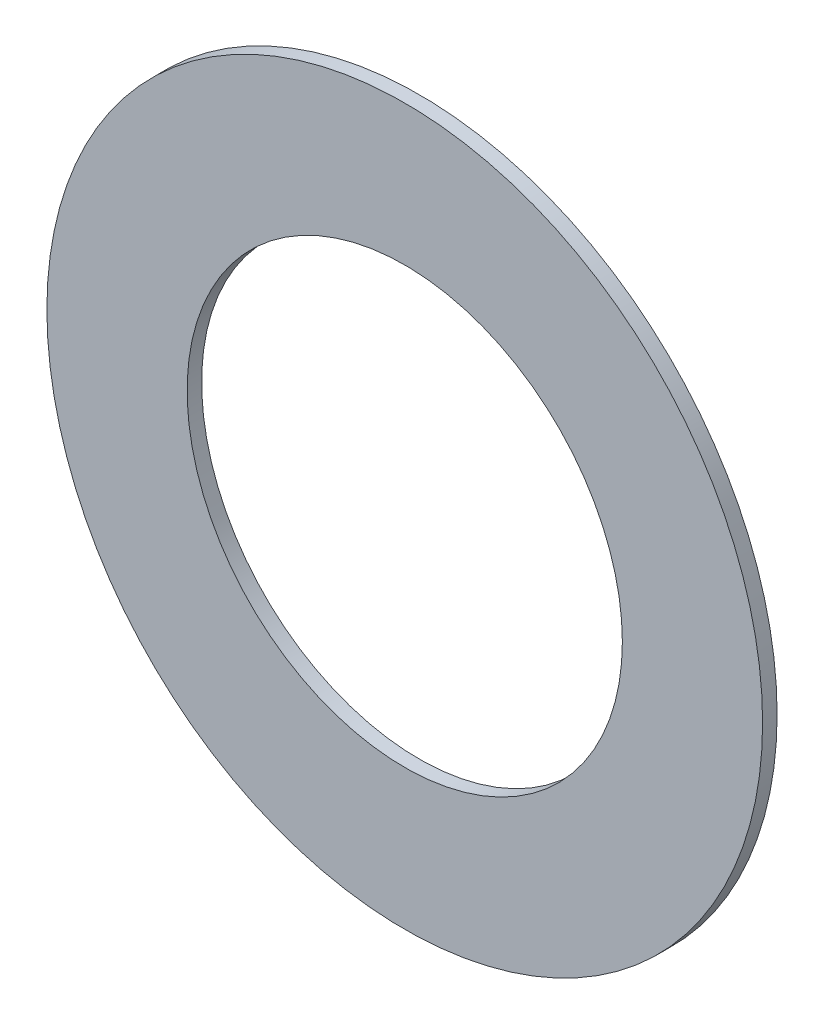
ISO-10303-21;
HEADER;
FILE_DESCRIPTION(('STEP AP214'),'2;1');
FILE_NAME('part.step','',(''),(''),'','','');
FILE_SCHEMA(('AUTOMOTIVE_DESIGN { 1 0 10303 214 1 1 1 1 }'));
ENDSEC;
DATA;
#1=APPLICATION_CONTEXT('core data for automotive mechanical design processes');
#2=APPLICATION_PROTOCOL_DEFINITION('international standard','automotive_design',2000,#1);
#3=PRODUCT_CONTEXT('',#1,'mechanical');
#4=PRODUCT('Part','Part','',(#3));
#5=PRODUCT_RELATED_PRODUCT_CATEGORY('part','',(#4));
#6=PRODUCT_DEFINITION_FORMATION('','',#4);
#7=PRODUCT_DEFINITION_CONTEXT('part definition',#1,'design');
#8=PRODUCT_DEFINITION('design','',#6,#7);
#9=PRODUCT_DEFINITION_SHAPE('','',#8);
#10=(LENGTH_UNIT() NAMED_UNIT(*) SI_UNIT(.MILLI.,.METRE.));
#11=(NAMED_UNIT(*) PLANE_ANGLE_UNIT() SI_UNIT($,.RADIAN.));
#12=(NAMED_UNIT(*) SI_UNIT($,.STERADIAN.) SOLID_ANGLE_UNIT());
#13=UNCERTAINTY_MEASURE_WITH_UNIT(LENGTH_MEASURE(1.E-05),#10,'distance_accuracy_value','');
#14=(GEOMETRIC_REPRESENTATION_CONTEXT(3) GLOBAL_UNCERTAINTY_ASSIGNED_CONTEXT((#13)) GLOBAL_UNIT_ASSIGNED_CONTEXT((#10,
#11,#12)) REPRESENTATION_CONTEXT('',''));
#15=CARTESIAN_POINT('',(0.,0.,0.));
#16=DIRECTION('',(0.,0.,1.));
#17=DIRECTION('',(1.,0.,0.));
#18=AXIS2_PLACEMENT_3D('',#15,#16,#17);
#19=CARTESIAN_POINT('',(0.,0.,1.5));
#20=DIRECTION('',(0.,0.,1.));
#21=DIRECTION('',(1.,0.,0.));
#22=AXIS2_PLACEMENT_3D('',#19,#20,#21);
#23=PLANE('',#22);
#24=CARTESIAN_POINT('',(0.,0.,1.5));
#25=DIRECTION('',(0.,0.,1.));
#26=DIRECTION('',(1.,0.,0.));
#27=AXIS2_PLACEMENT_3D('',#24,#25,#26);
#28=CIRCLE('',#27,37.);
#29=CARTESIAN_POINT('',(37.,0.,1.5));
#30=VERTEX_POINT('',#29);
#31=EDGE_CURVE('E10',#30,#30,#28,.T.);
#32=ORIENTED_EDGE('',*,*,#31,.T.);
#33=EDGE_LOOP('',(#32));
#34=FACE_BOUND('',#33,.T.);
#35=CARTESIAN_POINT('',(0.,0.,1.5));
#36=DIRECTION('',(0.,0.,1.));
#37=DIRECTION('',(1.,0.,0.));
#38=AXIS2_PLACEMENT_3D('',#35,#36,#37);
#39=CIRCLE('',#38,22.5);
#40=CARTESIAN_POINT('',(22.5,0.,1.5));
#41=VERTEX_POINT('',#40);
#42=EDGE_CURVE('E41',#41,#41,#39,.T.);
#43=ORIENTED_EDGE('',*,*,#42,.F.);
#44=EDGE_LOOP('',(#43));
#45=FACE_BOUND('',#44,.T.);
#46=ADVANCED_FACE('F30',(#34,#45),#23,.T.);
#47=CARTESIAN_POINT('',(0.,0.,0.));
#48=DIRECTION('',(0.,0.,1.));
#49=DIRECTION('',(1.,0.,0.));
#50=AXIS2_PLACEMENT_3D('',#47,#48,#49);
#51=PLANE('',#50);
#52=CARTESIAN_POINT('',(0.,0.,0.));
#53=DIRECTION('',(0.,0.,1.));
#54=DIRECTION('',(1.,0.,0.));
#55=AXIS2_PLACEMENT_3D('',#52,#53,#54);
#56=CIRCLE('',#55,37.);
#57=CARTESIAN_POINT('',(37.,0.,0.));
#58=VERTEX_POINT('',#57);
#59=EDGE_CURVE('E34',#58,#58,#56,.T.);
#60=ORIENTED_EDGE('',*,*,#59,.F.);
#61=EDGE_LOOP('',(#60));
#62=FACE_BOUND('',#61,.T.);
#63=CARTESIAN_POINT('',(0.,0.,0.));
#64=DIRECTION('',(0.,0.,1.));
#65=DIRECTION('',(1.,0.,0.));
#66=AXIS2_PLACEMENT_3D('',#63,#64,#65);
#67=CIRCLE('',#66,22.5);
#68=CARTESIAN_POINT('',(22.5,0.,0.));
#69=VERTEX_POINT('',#68);
#70=EDGE_CURVE('E43',#69,#69,#67,.T.);
#71=ORIENTED_EDGE('',*,*,#70,.T.);
#72=EDGE_LOOP('',(#71));
#73=FACE_BOUND('',#72,.T.);
#74=ADVANCED_FACE('F53',(#62,#73),#51,.F.);
#75=CARTESIAN_POINT('',(0.,0.,1.5));
#76=DIRECTION('',(0.,0.,-1.));
#77=DIRECTION('',(-1.,0.,0.));
#78=AXIS2_PLACEMENT_3D('',#75,#76,#77);
#79=CYLINDRICAL_SURFACE('',#78,37.);
#80=ORIENTED_EDGE('',*,*,#31,.F.);
#81=EDGE_LOOP('',(#80));
#82=FACE_BOUND('',#81,.T.);
#83=ORIENTED_EDGE('',*,*,#59,.T.);
#84=EDGE_LOOP('',(#83));
#85=FACE_BOUND('',#84,.T.);
#86=ADVANCED_FACE('F32',(#82,#85),#79,.T.);
#87=CARTESIAN_POINT('',(0.,0.,1.5));
#88=DIRECTION('',(0.,0.,-1.));
#89=DIRECTION('',(-1.,0.,0.));
#90=AXIS2_PLACEMENT_3D('',#87,#88,#89);
#91=CYLINDRICAL_SURFACE('',#90,22.5);
#92=ORIENTED_EDGE('',*,*,#42,.T.);
#93=EDGE_LOOP('',(#92));
#94=FACE_BOUND('',#93,.T.);
#95=ORIENTED_EDGE('',*,*,#70,.F.);
#96=EDGE_LOOP('',(#95));
#97=FACE_BOUND('',#96,.T.);
#98=ADVANCED_FACE('F49',(#94,#97),#91,.F.);
#99=CLOSED_SHELL('',(#46,#74,#86,#98));
#100=MANIFOLD_SOLID_BREP('B2',#99);
#101=ADVANCED_BREP_SHAPE_REPRESENTATION('',(#18,#100),#14);
#102=SHAPE_DEFINITION_REPRESENTATION(#9,#101);
ENDSEC;
END-ISO-10303-21;
